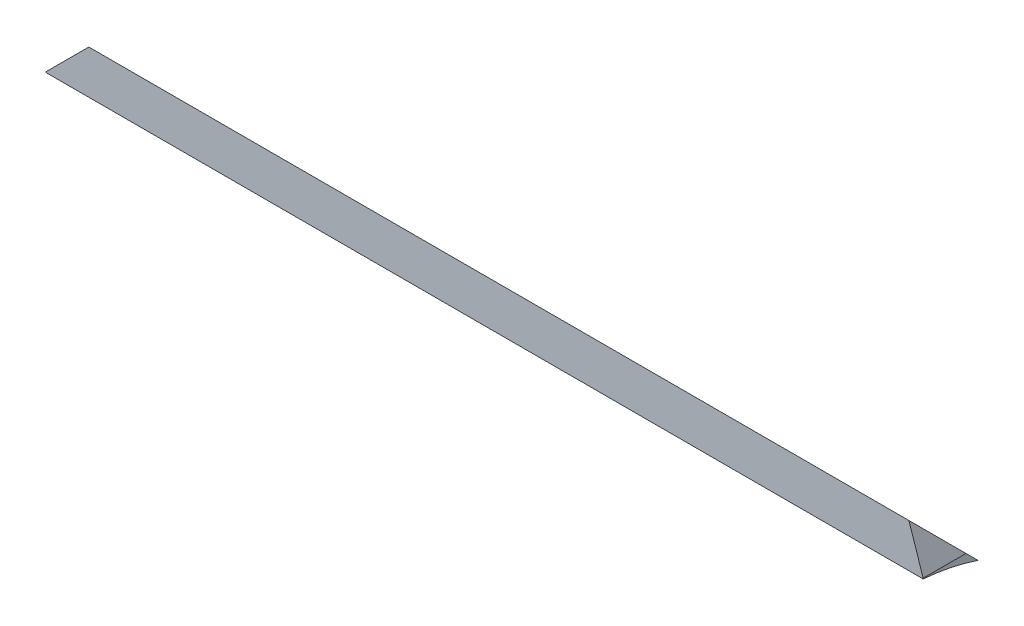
from build123d import *

# Parameters (mm, degrees)
SKETCH1_W          = 152.4
SKETCH1_H          = 12.7
EXTRUDE1_DEPTH     = 12.7
CUT_EXTRUDE1_DEPTH = 154.454683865
CUT_EXTRUDE2_DEPTH = 154.454683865
SKETCH5_OUTSIDE_W  = 184.998
SKETCH5_OUTSIDE_H  = 42.123
CUT_EXTRUDE7_DEPTH = 154.224592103


with BuildPart() as part:
    # Sketch1 → Extrude1 (new body)
    with BuildSketch(Plane(origin=(0, 0, 0), x_dir=(1, 0, 0), z_dir=(0, 1, 0))):
        with Locations((76.2, 6.35)):
            Rectangle(SKETCH1_W, SKETCH1_H)
    extrude(amount=EXTRUDE1_DEPTH)

    # Sketch2 → Cut-Extrude1 (cut, through all)
    with BuildSketch(Plane(origin=(152.4, 0, 0), x_dir=(0, 0, -1), z_dir=(1, 0, 0))):
        Polygon((0, 12.7), (12.7, 0), (12.7, 12.7), align=None)
    extrude(amount=-CUT_EXTRUDE1_DEPTH, mode=Mode.SUBTRACT)

    # Sketch3 → Cut-Extrude2 (cut, through all)
    with BuildSketch(Plane(origin=(152.4, 0, 0), x_dir=(0, 0, -1), z_dir=(1, 0, 0))):
        with BuildLine():
            Line((0, 2.086866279), (0, 22.108104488))
            Line((0, 22.108104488), (3.175, 22.108104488))
            Line((3.175, 22.108104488), (3.175, 1.959662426))
            ThreePointArc((3.175, 1.959662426), (-1.588773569, -77.256320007), (0, 2.086866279))
        make_face()
    extrude(amount=-CUT_EXTRUDE2_DEPTH, mode=Mode.SUBTRACT)

    # Sketch5 outside → Cut-Extrude7 (cut, through all)
    with BuildSketch(Plane.XY):
        with Locations((76.2, 4.7625)):
            Rectangle(SKETCH5_OUTSIDE_W, SKETCH5_OUTSIDE_H)
        Polygon((152.4, 2.086866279), (152.4, 0), (0, 0), (0, 2.086866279), (76.2, 78.286866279), (127, 78.286866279), align=None, mode=Mode.SUBTRACT)
    extrude(amount=-CUT_EXTRUDE7_DEPTH, mode=Mode.SUBTRACT)


solid = part.part
